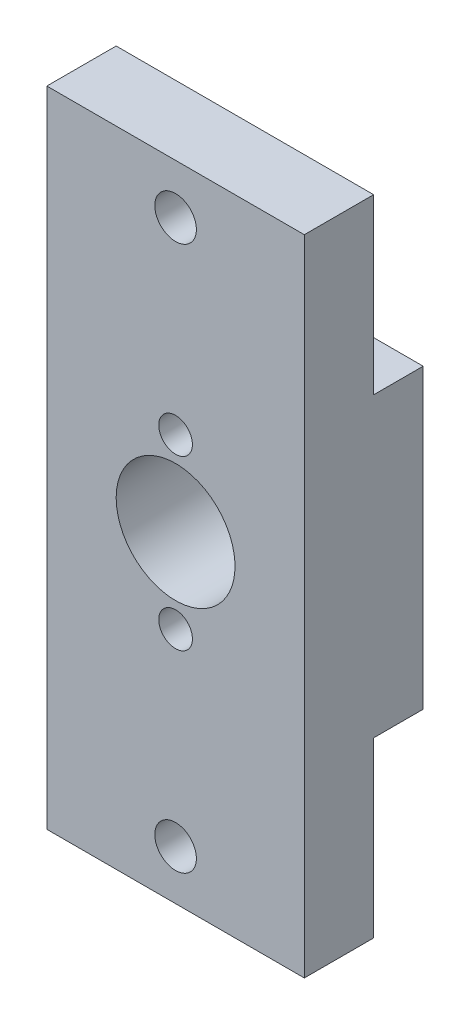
from build123d import *

# Parameters (mm, degrees)
SKETCH_1_W                   = 30
SKETCH_1_H                   = 30
EXTRUDE_1_DEPTH              = 5
SKETCH_2_W                   = 30
SKETCH_2_H                   = 55
EXTRUDE_2_DEPTH              = 7
SKETCH_5_R                   = 6
CUT_EXTRUDE_1_DEPTH          = 34.544746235
HOLE_WIZARD_M3_1_D           = 3.4
HOLE_WIZARD_M3_1_CSINK_D     = 6.6
HOLE_WIZARD_M3_1_CSINK_ANGLE = 90
SKETCH_10_W                  = 30
SKETCH_10_H                  = 7
EXTRUDE_3_DEPTH              = 5
SKETCH_11_W                  = 30
SKETCH_11_H                  = 7
EXTRUDE_4_DEPTH              = 5
HOLE_WIZARD_M5_1_D           = 4.2
CUT_EXTRUDE_2_DEPTH          = 2
CUT_EXTRUDE_3_DEPTH          = 2


with BuildPart() as part:
    # Sketch 1 → Extrude 1 (new body)
    with BuildSketch(Plane.XY):
        Rectangle(SKETCH_1_W, SKETCH_1_H)
    extrude(amount=EXTRUDE_1_DEPTH)

    # Sketch 2 → Extrude 2 (add)
    with BuildSketch(Plane.XY.offset(5)):
        Rectangle(SKETCH_2_W, SKETCH_2_H)
    extrude(amount=EXTRUDE_2_DEPTH)

    # Sketch 5 → Cut-Extrude 1 (cut, through all)
    with BuildSketch(Plane(origin=(0, 0, 0), x_dir=(-1, 0, 0), z_dir=(0, 0, -1))):
        Circle(SKETCH_5_R)
    extrude(amount=-CUT_EXTRUDE_1_DEPTH, mode=Mode.SUBTRACT)

    # Hole Wizard M3 _1 (through all)
    with Locations(Plane(origin=(0, 0, 0), x_dir=(-1, 0, 0), z_dir=(0, 0, -1))):
        with Locations((0, 8.5), (0, -8.5)):
            CounterSinkHole(HOLE_WIZARD_M3_1_D / 2, HOLE_WIZARD_M3_1_CSINK_D / 2, counter_sink_angle=HOLE_WIZARD_M3_1_CSINK_ANGLE)

    # Sketch 10 → Extrude 3 (add)
    with BuildSketch(Plane(origin=(0, 27.5, 0), x_dir=(1, 0, 0), z_dir=(0, 1, 0))):
        with Locations((0, -8.5)):
            Rectangle(SKETCH_10_W, SKETCH_10_H)
    extrude(amount=EXTRUDE_3_DEPTH)

    # Sketch 11 → Extrude 4 (add)
    with BuildSketch(Plane.XZ.offset(27.5)):
        with Locations((0, 8.5)):
            Rectangle(SKETCH_11_W, SKETCH_11_H)
    extrude(amount=EXTRUDE_4_DEPTH)

    # Hole Wizard M5 _1 (through all)
    with Locations(Plane.XY.offset(12)):
        with Locations((0, 27.5), (0, -27.5)):
            Hole(HOLE_WIZARD_M5_1_D / 2)

    # Sketch 14 → Cut-Extrude 2 (cut)
    with BuildSketch(Plane(origin=(15, 0, 0), x_dir=(0, 0, -1), z_dir=(1, 0, 0))):
        Polygon((0, -15), (0, 15), (-5, 15), (-5, 32.5), (-12, 32.5), (-12, -32.5), (-5, -32.5), (-5, -15), align=None)
    extrude(amount=-CUT_EXTRUDE_2_DEPTH, mode=Mode.SUBTRACT)

    # Sketch 15 → Cut-Extrude 3 (cut)
    with BuildSketch(Plane.ZY.offset(15)):
        Polygon((0, 15), (0, -15), (5, -15), (5, -32.5), (12, -32.5), (12, 32.5), (5, 32.5), (5, 15), align=None)
    extrude(amount=-CUT_EXTRUDE_3_DEPTH, mode=Mode.SUBTRACT)


solid = part.part
